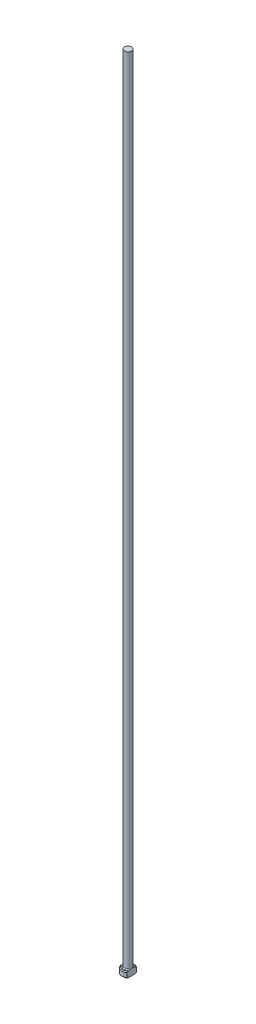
from build123d import *
from build123d.topology import SkipClean

# Parameters (mm, degrees)
CHAMFER1_SIZE = 0.2
FILLET1_R     = 0.2
KEY_DEPTH     = 201.011249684


with BuildPart() as part:
    # Sketch1 → Revolve1 (revolve)
    with BuildSketch(Plane.XY, mode=Mode.PRIVATE) as revolve1_sk:
        Polygon((0, 0), (-1.5, 0), (-1.5, 1.5), (-0.9, 1.5), (-0.9, 200), (0, 200), align=None)
    revolve(revolve1_sk.sketch.rotate(Axis((0, 259.958771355, 0), (0, -1, 0)), 270), axis=Axis((0, 259.958771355, 0), (0, -1, 0)))

    # Chamfer1
    chamfer1_edges = [part.edges().sort_by_distance(p)[0] for p in [
        (0, 1.5, -1.5),
        (0, 0, -1.5),
    ]]
    chamfer(chamfer1_edges, length=CHAMFER1_SIZE)

    # Fillet1
    fillet1_edges = [part.edges().sort_by_distance(p)[0] for p in [
        (0, 1.5, -0.9),
    ]]
    fillet(fillet1_edges, radius=FILLET1_R)

    # Sketch2 → KEY (cut, through all)
    with SkipClean():  # the faces are left unmerged after this step: merging them gives an invalid solid
        with BuildSketch(Plane(origin=(0, 0, 0), x_dir=(1, 0, 0), z_dir=(0, 1, 0))):
            with BuildLine():
                Line((0.9, 1.2), (0.9, -1.2))
                ThreePointArc((0.9, -1.2), (1.5, 0), (0.9, 1.2))
            make_face()
        extrude(amount=KEY_DEPTH, mode=Mode.SUBTRACT)


solid = part.part
